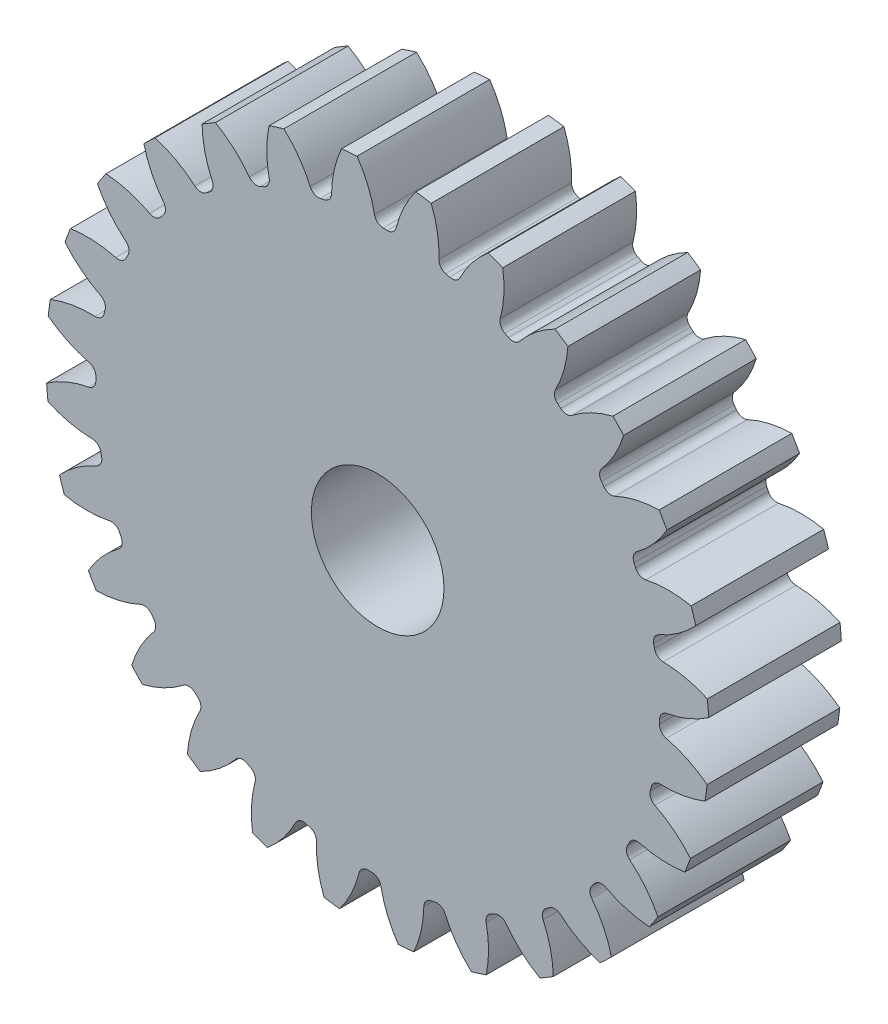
from build123d import *

# Parameters (mm, degrees)
SKETCH3_R         = 254
GEARBODY_DEPTH    = 101.6
TOOTHCUT_DEPTH    = 374.3022368
CIRPATTERN1_COUNT = 28
BOREDIA_R         = 50.8
BORE_DEPTH        = 12700


with BuildPart() as part:
    # Sketch3 → gearBody (new body)
    with BuildSketch(Plane.XY):
        Circle(SKETCH3_R)
    extrude(amount=GEARBODY_DEPTH)

    # Sketch2 → toothCut (cut, through all)
    with BuildSketch(Plane.XY):
        with BuildLine():
            ThreePointArc((215.777086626, -7.284153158), (215.823872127, -5.732906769), (215.859505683, -4.181364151))
            ThreePointArc((215.859505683, -4.181364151), (217.486138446, 0.13361477), (221.469459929, 2.457001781))
            ThreePointArc((221.469459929, 2.457001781), (238.458413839, 7.570743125), (254, 16.128430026))
            ThreePointArc((254, 16.128430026), (254.421801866, -6.758179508), (252.78558292, -29.590122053))
            ThreePointArc((252.78558292, -29.590122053), (237.720226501, -20.219426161), (221.026710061, -14.210980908))
            ThreePointArc((221.026710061, -14.210980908), (217.172350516, -11.679402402), (215.777086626, -7.284153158))
        make_face()
    toothcut = extrude(amount=TOOTHCUT_DEPTH, mode=Mode.SUBTRACT)

    # CirPattern1: toothCut ×28 about axis
    cirpattern1_axis = Axis((0, 0, 0), (0, 0, 1))
    for i in range(1, CIRPATTERN1_COUNT):
        add(toothcut.rotate(cirpattern1_axis, i * 360 / CIRPATTERN1_COUNT), mode=Mode.SUBTRACT)

    # boreDia → bore (cut, symmetric)
    with BuildSketch(Plane.XY):
        Circle(BOREDIA_R)
    extrude(amount=BORE_DEPTH, both=True, mode=Mode.SUBTRACT)


solid = part.part
